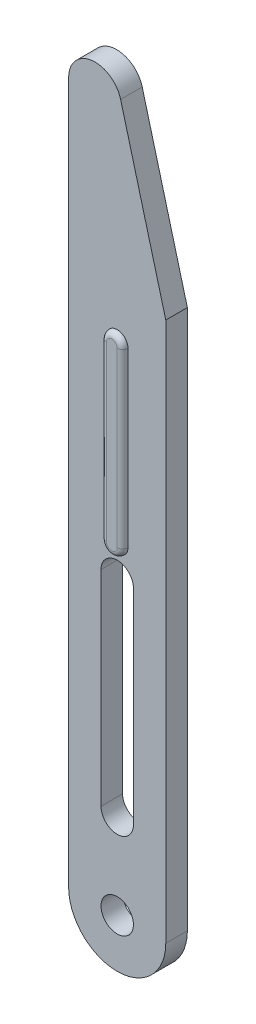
ISO-10303-21;
HEADER;
FILE_DESCRIPTION(('STEP AP214'),'2;1');
FILE_NAME('part.step','',(''),(''),'','','');
FILE_SCHEMA(('AUTOMOTIVE_DESIGN { 1 0 10303 214 1 1 1 1 }'));
ENDSEC;
DATA;
#1=APPLICATION_CONTEXT('core data for automotive mechanical design processes');
#2=APPLICATION_PROTOCOL_DEFINITION('international standard','automotive_design',2000,#1);
#3=PRODUCT_CONTEXT('',#1,'mechanical');
#4=PRODUCT('Part','Part','',(#3));
#5=PRODUCT_RELATED_PRODUCT_CATEGORY('part','',(#4));
#6=PRODUCT_DEFINITION_FORMATION('','',#4);
#7=PRODUCT_DEFINITION_CONTEXT('part definition',#1,'design');
#8=PRODUCT_DEFINITION('design','',#6,#7);
#9=PRODUCT_DEFINITION_SHAPE('','',#8);
#10=(LENGTH_UNIT() NAMED_UNIT(*) SI_UNIT(.MILLI.,.METRE.));
#11=(NAMED_UNIT(*) PLANE_ANGLE_UNIT() SI_UNIT($,.RADIAN.));
#12=(NAMED_UNIT(*) SI_UNIT($,.STERADIAN.) SOLID_ANGLE_UNIT());
#13=UNCERTAINTY_MEASURE_WITH_UNIT(LENGTH_MEASURE(1.E-05),#10,'distance_accuracy_value','');
#14=(GEOMETRIC_REPRESENTATION_CONTEXT(3) GLOBAL_UNCERTAINTY_ASSIGNED_CONTEXT((#13)) GLOBAL_UNIT_ASSIGNED_CONTEXT((#10,
#11,#12)) REPRESENTATION_CONTEXT('',''));
#15=CARTESIAN_POINT('',(0.,0.,0.));
#16=DIRECTION('',(0.,0.,1.));
#17=DIRECTION('',(1.,0.,0.));
#18=AXIS2_PLACEMENT_3D('',#15,#16,#17);
#19=CARTESIAN_POINT('',(4.5,0.,2.));
#20=DIRECTION('',(0.,0.,1.));
#21=DIRECTION('',(1.,0.,0.));
#22=AXIS2_PLACEMENT_3D('',#19,#20,#21);
#23=PLANE('',#22);
#24=CARTESIAN_POINT('',(4.5,0.,2.));
#25=DIRECTION('',(0.,0.,1.));
#26=DIRECTION('',(1.,0.,0.));
#27=AXIS2_PLACEMENT_3D('',#24,#25,#26);
#28=CIRCLE('',#27,1.5);
#29=CARTESIAN_POINT('',(6.,0.,2.));
#30=VERTEX_POINT('',#29);
#31=EDGE_CURVE('E200',#30,#30,#28,.T.);
#32=ORIENTED_EDGE('',*,*,#31,.F.);
#33=EDGE_LOOP('',(#32));
#34=FACE_BOUND('',#33,.T.);
#35=CARTESIAN_POINT('',(4.5,0.,2.));
#36=DIRECTION('',(0.,0.,1.));
#37=DIRECTION('',(1.,0.,0.));
#38=AXIS2_PLACEMENT_3D('',#35,#36,#37);
#39=CIRCLE('',#38,4.5);
#40=CARTESIAN_POINT('',(0.,0.,2.));
#41=VERTEX_POINT('',#40);
#42=CARTESIAN_POINT('',(9.,0.,2.));
#43=VERTEX_POINT('',#42);
#44=EDGE_CURVE('E245',#41,#43,#39,.T.);
#45=ORIENTED_EDGE('',*,*,#44,.T.);
#46=DIRECTION('',(0.,1.,0.));
#47=VECTOR('',#46,1.);
#48=CARTESIAN_POINT('',(9.,0.,2.));
#49=LINE('',#48,#47);
#50=CARTESIAN_POINT('',(9.,50.0211403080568,2.));
#51=VERTEX_POINT('',#50);
#52=EDGE_CURVE('E248',#43,#51,#49,.T.);
#53=ORIENTED_EDGE('',*,*,#52,.T.);
#54=DIRECTION('',(-0.258819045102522,0.965925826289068,0.));
#55=VECTOR('',#54,1.);
#56=CARTESIAN_POINT('',(9.,50.0211403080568,2.));
#57=LINE('',#56,#55);
#58=CARTESIAN_POINT('',(4.81651827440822,65.6341066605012,2.));
#59=VERTEX_POINT('',#58);
#60=EDGE_CURVE('E250',#51,#59,#57,.T.);
#61=ORIENTED_EDGE('',*,*,#60,.T.);
#62=CARTESIAN_POINT('',(2.45,65.,2.));
#63=DIRECTION('',(0.,0.,1.));
#64=DIRECTION('',(1.,0.,0.));
#65=AXIS2_PLACEMENT_3D('',#62,#63,#64);
#66=CIRCLE('',#65,2.45);
#67=CARTESIAN_POINT('',(0.,65.,2.));
#68=VERTEX_POINT('',#67);
#69=EDGE_CURVE('E252',#59,#68,#66,.T.);
#70=ORIENTED_EDGE('',*,*,#69,.T.);
#71=DIRECTION('',(0.,-1.,0.));
#72=VECTOR('',#71,1.);
#73=CARTESIAN_POINT('',(0.,0.,2.));
#74=LINE('',#73,#72);
#75=EDGE_CURVE('E254',#68,#41,#74,.T.);
#76=ORIENTED_EDGE('',*,*,#75,.T.);
#77=EDGE_LOOP('',(#45,#53,#61,#70,#76));
#78=FACE_BOUND('',#77,.T.);
#79=DIRECTION('',(0.,-1.,0.));
#80=VECTOR('',#79,1.);
#81=CARTESIAN_POINT('',(3.,27.,2.));
#82=LINE('',#81,#80);
#83=CARTESIAN_POINT('',(3.,27.,2.));
#84=VERTEX_POINT('',#83);
#85=CARTESIAN_POINT('',(2.99999999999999,8.,2.));
#86=VERTEX_POINT('',#85);
#87=EDGE_CURVE('E217',#84,#86,#82,.T.);
#88=ORIENTED_EDGE('',*,*,#87,.F.);
#89=CARTESIAN_POINT('',(4.5,27.,2.));
#90=DIRECTION('',(0.,0.,1.));
#91=DIRECTION('',(1.,0.,0.));
#92=AXIS2_PLACEMENT_3D('',#89,#90,#91);
#93=CIRCLE('',#92,1.5);
#94=CARTESIAN_POINT('',(6.,27.,2.));
#95=VERTEX_POINT('',#94);
#96=EDGE_CURVE('E215',#95,#84,#93,.T.);
#97=ORIENTED_EDGE('',*,*,#96,.F.);
#98=DIRECTION('',(0.,1.,0.));
#99=VECTOR('',#98,1.);
#100=CARTESIAN_POINT('',(6.,27.,2.));
#101=LINE('',#100,#99);
#102=CARTESIAN_POINT('',(6.,8.,2.));
#103=VERTEX_POINT('',#102);
#104=EDGE_CURVE('E222',#103,#95,#101,.T.);
#105=ORIENTED_EDGE('',*,*,#104,.F.);
#106=CARTESIAN_POINT('',(4.5,8.,2.));
#107=DIRECTION('',(0.,0.,1.));
#108=DIRECTION('',(1.,0.,0.));
#109=AXIS2_PLACEMENT_3D('',#106,#107,#108);
#110=CIRCLE('',#109,1.5);
#111=EDGE_CURVE('E219',#86,#103,#110,.T.);
#112=ORIENTED_EDGE('',*,*,#111,.F.);
#113=EDGE_LOOP('',(#88,#97,#105,#112));
#114=FACE_BOUND('',#113,.T.);
#115=DIRECTION('',(0.,1.,0.));
#116=VECTOR('',#115,1.);
#117=CARTESIAN_POINT('',(3.5,0.,2.));
#118=LINE('',#117,#116);
#119=CARTESIAN_POINT('',(3.49999999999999,30.,2.));
#120=VERTEX_POINT('',#119);
#121=CARTESIAN_POINT('',(3.5,46.,2.));
#122=VERTEX_POINT('',#121);
#123=EDGE_CURVE('E193',#120,#122,#118,.T.);
#124=ORIENTED_EDGE('',*,*,#123,.T.);
#125=CARTESIAN_POINT('',(4.5,46.,2.));
#126=DIRECTION('',(0.,0.,1.));
#127=DIRECTION('',(1.,0.,0.));
#128=AXIS2_PLACEMENT_3D('',#125,#126,#127);
#129=CIRCLE('',#128,1.);
#130=CARTESIAN_POINT('',(5.49999999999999,46.,2.));
#131=VERTEX_POINT('',#130);
#132=EDGE_CURVE('E195',#122,#131,#129,.F.);
#133=ORIENTED_EDGE('',*,*,#132,.T.);
#134=DIRECTION('',(0.,-1.,0.));
#135=VECTOR('',#134,1.);
#136=CARTESIAN_POINT('',(5.5,0.,2.));
#137=LINE('',#136,#135);
#138=CARTESIAN_POINT('',(5.5,30.,2.));
#139=VERTEX_POINT('',#138);
#140=EDGE_CURVE('E188',#131,#139,#137,.T.);
#141=ORIENTED_EDGE('',*,*,#140,.T.);
#142=CARTESIAN_POINT('',(4.5,30.,2.));
#143=DIRECTION('',(0.,0.,1.));
#144=DIRECTION('',(1.,0.,0.));
#145=AXIS2_PLACEMENT_3D('',#142,#143,#144);
#146=CIRCLE('',#145,1.);
#147=EDGE_CURVE('E191',#139,#120,#146,.F.);
#148=ORIENTED_EDGE('',*,*,#147,.T.);
#149=EDGE_LOOP('',(#124,#133,#141,#148));
#150=FACE_BOUND('',#149,.T.);
#151=ADVANCED_FACE('F34',(#34,#78,#114,#150),#23,.T.);
#152=CARTESIAN_POINT('',(4.5,0.,0.));
#153=DIRECTION('',(0.,0.,1.));
#154=DIRECTION('',(1.,0.,0.));
#155=AXIS2_PLACEMENT_3D('',#152,#153,#154);
#156=PLANE('',#155);
#157=CARTESIAN_POINT('',(4.5,0.,0.));
#158=DIRECTION('',(0.,0.,1.));
#159=DIRECTION('',(1.,0.,0.));
#160=AXIS2_PLACEMENT_3D('',#157,#158,#159);
#161=CIRCLE('',#160,1.5);
#162=CARTESIAN_POINT('',(6.,0.,0.));
#163=VERTEX_POINT('',#162);
#164=EDGE_CURVE('E197',#163,#163,#161,.T.);
#165=ORIENTED_EDGE('',*,*,#164,.T.);
#166=EDGE_LOOP('',(#165));
#167=FACE_BOUND('',#166,.T.);
#168=CARTESIAN_POINT('',(4.5,0.,0.));
#169=DIRECTION('',(0.,0.,1.));
#170=DIRECTION('',(1.,0.,0.));
#171=AXIS2_PLACEMENT_3D('',#168,#169,#170);
#172=CIRCLE('',#171,4.5);
#173=CARTESIAN_POINT('',(0.,0.,0.));
#174=VERTEX_POINT('',#173);
#175=CARTESIAN_POINT('',(9.,0.,0.));
#176=VERTEX_POINT('',#175);
#177=EDGE_CURVE('E234',#174,#176,#172,.T.);
#178=ORIENTED_EDGE('',*,*,#177,.F.);
#179=DIRECTION('',(0.,-1.,0.));
#180=VECTOR('',#179,1.);
#181=CARTESIAN_POINT('',(0.,0.,0.));
#182=LINE('',#181,#180);
#183=CARTESIAN_POINT('',(0.,65.,0.));
#184=VERTEX_POINT('',#183);
#185=EDGE_CURVE('E243',#184,#174,#182,.T.);
#186=ORIENTED_EDGE('',*,*,#185,.F.);
#187=CARTESIAN_POINT('',(2.45,65.,0.));
#188=DIRECTION('',(0.,0.,1.));
#189=DIRECTION('',(1.,0.,0.));
#190=AXIS2_PLACEMENT_3D('',#187,#188,#189);
#191=CIRCLE('',#190,2.45);
#192=CARTESIAN_POINT('',(4.81651827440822,65.6341066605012,0.));
#193=VERTEX_POINT('',#192);
#194=EDGE_CURVE('E241',#193,#184,#191,.T.);
#195=ORIENTED_EDGE('',*,*,#194,.F.);
#196=DIRECTION('',(-0.258819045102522,0.965925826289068,0.));
#197=VECTOR('',#196,1.);
#198=CARTESIAN_POINT('',(9.,50.0211403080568,0.));
#199=LINE('',#198,#197);
#200=CARTESIAN_POINT('',(9.,50.0211403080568,0.));
#201=VERTEX_POINT('',#200);
#202=EDGE_CURVE('E239',#201,#193,#199,.T.);
#203=ORIENTED_EDGE('',*,*,#202,.F.);
#204=DIRECTION('',(0.,1.,0.));
#205=VECTOR('',#204,1.);
#206=CARTESIAN_POINT('',(9.,0.,0.));
#207=LINE('',#206,#205);
#208=EDGE_CURVE('E237',#176,#201,#207,.T.);
#209=ORIENTED_EDGE('',*,*,#208,.F.);
#210=EDGE_LOOP('',(#178,#186,#195,#203,#209));
#211=FACE_BOUND('',#210,.T.);
#212=CARTESIAN_POINT('',(4.5,27.,0.));
#213=DIRECTION('',(0.,0.,1.));
#214=DIRECTION('',(1.,0.,0.));
#215=AXIS2_PLACEMENT_3D('',#212,#213,#214);
#216=CIRCLE('',#215,1.5);
#217=CARTESIAN_POINT('',(6.,27.,0.));
#218=VERTEX_POINT('',#217);
#219=CARTESIAN_POINT('',(3.,27.,0.));
#220=VERTEX_POINT('',#219);
#221=EDGE_CURVE('E203',#218,#220,#216,.T.);
#222=ORIENTED_EDGE('',*,*,#221,.T.);
#223=DIRECTION('',(0.,-1.,0.));
#224=VECTOR('',#223,1.);
#225=CARTESIAN_POINT('',(3.,27.,0.));
#226=LINE('',#225,#224);
#227=CARTESIAN_POINT('',(2.99999999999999,8.,0.));
#228=VERTEX_POINT('',#227);
#229=EDGE_CURVE('E206',#220,#228,#226,.T.);
#230=ORIENTED_EDGE('',*,*,#229,.T.);
#231=CARTESIAN_POINT('',(4.5,8.,0.));
#232=DIRECTION('',(0.,0.,1.));
#233=DIRECTION('',(1.,0.,0.));
#234=AXIS2_PLACEMENT_3D('',#231,#232,#233);
#235=CIRCLE('',#234,1.5);
#236=CARTESIAN_POINT('',(6.,8.,0.));
#237=VERTEX_POINT('',#236);
#238=EDGE_CURVE('E209',#228,#237,#235,.T.);
#239=ORIENTED_EDGE('',*,*,#238,.T.);
#240=DIRECTION('',(0.,1.,0.));
#241=VECTOR('',#240,1.);
#242=CARTESIAN_POINT('',(6.,27.,0.));
#243=LINE('',#242,#241);
#244=EDGE_CURVE('E212',#237,#218,#243,.T.);
#245=ORIENTED_EDGE('',*,*,#244,.T.);
#246=EDGE_LOOP('',(#222,#230,#239,#245));
#247=FACE_BOUND('',#246,.T.);
#248=CARTESIAN_POINT('',(4.5,46.,0.));
#249=DIRECTION('',(0.,0.,1.));
#250=DIRECTION('',(1.,0.,0.));
#251=AXIS2_PLACEMENT_3D('',#248,#249,#250);
#252=CIRCLE('',#251,1.);
#253=CARTESIAN_POINT('',(3.5,46.,0.));
#254=VERTEX_POINT('',#253);
#255=CARTESIAN_POINT('',(5.49999999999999,46.,0.));
#256=VERTEX_POINT('',#255);
#257=EDGE_CURVE('E271',#254,#256,#252,.F.);
#258=ORIENTED_EDGE('',*,*,#257,.F.);
#259=DIRECTION('',(0.,1.,0.));
#260=VECTOR('',#259,1.);
#261=CARTESIAN_POINT('',(3.5,0.,0.));
#262=LINE('',#261,#260);
#263=CARTESIAN_POINT('',(3.49999999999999,30.,0.));
#264=VERTEX_POINT('',#263);
#265=EDGE_CURVE('E157',#264,#254,#262,.T.);
#266=ORIENTED_EDGE('',*,*,#265,.F.);
#267=CARTESIAN_POINT('',(4.5,30.,0.));
#268=DIRECTION('',(0.,0.,1.));
#269=DIRECTION('',(1.,0.,0.));
#270=AXIS2_PLACEMENT_3D('',#267,#268,#269);
#271=CIRCLE('',#270,1.);
#272=CARTESIAN_POINT('',(5.5,30.,0.));
#273=VERTEX_POINT('',#272);
#274=EDGE_CURVE('E151',#273,#264,#271,.F.);
#275=ORIENTED_EDGE('',*,*,#274,.F.);
#276=DIRECTION('',(0.,-1.,0.));
#277=VECTOR('',#276,1.);
#278=CARTESIAN_POINT('',(5.5,0.,0.));
#279=LINE('',#278,#277);
#280=EDGE_CURVE('E154',#256,#273,#279,.T.);
#281=ORIENTED_EDGE('',*,*,#280,.F.);
#282=EDGE_LOOP('',(#258,#266,#275,#281));
#283=FACE_BOUND('',#282,.T.);
#284=ADVANCED_FACE('F153',(#167,#211,#247,#283),#156,.F.);
#285=CARTESIAN_POINT('',(4.5,0.,2.));
#286=DIRECTION('',(0.,0.,-1.));
#287=DIRECTION('',(-1.,0.,0.));
#288=AXIS2_PLACEMENT_3D('',#285,#286,#287);
#289=CYLINDRICAL_SURFACE('',#288,4.5);
#290=ORIENTED_EDGE('',*,*,#177,.T.);
#291=DIRECTION('',(0.,0.,-1.));
#292=VECTOR('',#291,1.);
#293=CARTESIAN_POINT('',(9.,0.,2.));
#294=LINE('',#293,#292);
#295=EDGE_CURVE('E168',#43,#176,#294,.T.);
#296=ORIENTED_EDGE('',*,*,#295,.F.);
#297=ORIENTED_EDGE('',*,*,#44,.F.);
#298=DIRECTION('',(0.,0.,-1.));
#299=VECTOR('',#298,1.);
#300=CARTESIAN_POINT('',(0.,0.,2.));
#301=LINE('',#300,#299);
#302=EDGE_CURVE('E256',#41,#174,#301,.T.);
#303=ORIENTED_EDGE('',*,*,#302,.T.);
#304=EDGE_LOOP('',(#290,#296,#297,#303));
#305=FACE_BOUND('',#304,.T.);
#306=ADVANCED_FACE('F36',(#305),#289,.T.);
#307=CARTESIAN_POINT('',(9.,0.,2.));
#308=DIRECTION('',(-1.,0.,0.));
#309=DIRECTION('',(0.,-1.,0.));
#310=AXIS2_PLACEMENT_3D('',#307,#308,#309);
#311=PLANE('',#310);
#312=ORIENTED_EDGE('',*,*,#208,.T.);
#313=DIRECTION('',(0.,0.,-1.));
#314=VECTOR('',#313,1.);
#315=CARTESIAN_POINT('',(9.,50.0211403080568,2.));
#316=LINE('',#315,#314);
#317=EDGE_CURVE('E265',#51,#201,#316,.T.);
#318=ORIENTED_EDGE('',*,*,#317,.F.);
#319=ORIENTED_EDGE('',*,*,#52,.F.);
#320=ORIENTED_EDGE('',*,*,#295,.T.);
#321=EDGE_LOOP('',(#312,#318,#319,#320));
#322=FACE_BOUND('',#321,.T.);
#323=ADVANCED_FACE('F320',(#322),#311,.F.);
#324=CARTESIAN_POINT('',(9.,50.0211403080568,2.));
#325=DIRECTION('',(-0.965925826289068,-0.258819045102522,0.));
#326=DIRECTION('',(0.258819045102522,-0.965925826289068,0.));
#327=AXIS2_PLACEMENT_3D('',#324,#325,#326);
#328=PLANE('',#327);
#329=ORIENTED_EDGE('',*,*,#202,.T.);
#330=DIRECTION('',(0.,0.,-1.));
#331=VECTOR('',#330,1.);
#332=CARTESIAN_POINT('',(4.81651827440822,65.6341066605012,2.));
#333=LINE('',#332,#331);
#334=EDGE_CURVE('E262',#59,#193,#333,.T.);
#335=ORIENTED_EDGE('',*,*,#334,.F.);
#336=ORIENTED_EDGE('',*,*,#60,.F.);
#337=ORIENTED_EDGE('',*,*,#317,.T.);
#338=EDGE_LOOP('',(#329,#335,#336,#337));
#339=FACE_BOUND('',#338,.T.);
#340=ADVANCED_FACE('F317',(#339),#328,.F.);
#341=CARTESIAN_POINT('',(2.45,65.,2.));
#342=DIRECTION('',(0.,0.,-1.));
#343=DIRECTION('',(-1.,0.,0.));
#344=AXIS2_PLACEMENT_3D('',#341,#342,#343);
#345=CYLINDRICAL_SURFACE('',#344,2.45);
#346=ORIENTED_EDGE('',*,*,#194,.T.);
#347=DIRECTION('',(0.,0.,-1.));
#348=VECTOR('',#347,1.);
#349=CARTESIAN_POINT('',(0.,65.,2.));
#350=LINE('',#349,#348);
#351=EDGE_CURVE('E259',#68,#184,#350,.T.);
#352=ORIENTED_EDGE('',*,*,#351,.F.);
#353=ORIENTED_EDGE('',*,*,#69,.F.);
#354=ORIENTED_EDGE('',*,*,#334,.T.);
#355=EDGE_LOOP('',(#346,#352,#353,#354));
#356=FACE_BOUND('',#355,.T.);
#357=ADVANCED_FACE('F313',(#356),#345,.T.);
#358=CARTESIAN_POINT('',(0.,0.,2.));
#359=DIRECTION('',(1.,0.,0.));
#360=DIRECTION('',(0.,0.,-1.));
#361=AXIS2_PLACEMENT_3D('',#358,#359,#360);
#362=PLANE('',#361);
#363=ORIENTED_EDGE('',*,*,#185,.T.);
#364=ORIENTED_EDGE('',*,*,#302,.F.);
#365=ORIENTED_EDGE('',*,*,#75,.F.);
#366=ORIENTED_EDGE('',*,*,#351,.T.);
#367=EDGE_LOOP('',(#363,#364,#365,#366));
#368=FACE_BOUND('',#367,.T.);
#369=ADVANCED_FACE('F309',(#368),#362,.F.);
#370=CARTESIAN_POINT('',(4.5,27.,2.));
#371=DIRECTION('',(0.,0.,-1.));
#372=DIRECTION('',(-1.,0.,0.));
#373=AXIS2_PLACEMENT_3D('',#370,#371,#372);
#374=CYLINDRICAL_SURFACE('',#373,1.5);
#375=ORIENTED_EDGE('',*,*,#221,.F.);
#376=DIRECTION('',(0.,0.,-1.));
#377=VECTOR('',#376,1.);
#378=CARTESIAN_POINT('',(6.,27.,2.));
#379=LINE('',#378,#377);
#380=EDGE_CURVE('E224',#95,#218,#379,.T.);
#381=ORIENTED_EDGE('',*,*,#380,.F.);
#382=ORIENTED_EDGE('',*,*,#96,.T.);
#383=DIRECTION('',(0.,0.,-1.));
#384=VECTOR('',#383,1.);
#385=CARTESIAN_POINT('',(3.,27.,2.));
#386=LINE('',#385,#384);
#387=EDGE_CURVE('E231',#84,#220,#386,.T.);
#388=ORIENTED_EDGE('',*,*,#387,.T.);
#389=EDGE_LOOP('',(#375,#381,#382,#388));
#390=FACE_BOUND('',#389,.T.);
#391=ADVANCED_FACE('F312',(#390),#374,.F.);
#392=CARTESIAN_POINT('',(3.,27.,2.));
#393=DIRECTION('',(1.,0.,0.));
#394=DIRECTION('',(0.,1.,0.));
#395=AXIS2_PLACEMENT_3D('',#392,#393,#394);
#396=PLANE('',#395);
#397=ORIENTED_EDGE('',*,*,#229,.F.);
#398=ORIENTED_EDGE('',*,*,#387,.F.);
#399=ORIENTED_EDGE('',*,*,#87,.T.);
#400=DIRECTION('',(0.,0.,-1.));
#401=VECTOR('',#400,1.);
#402=CARTESIAN_POINT('',(2.99999999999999,8.,2.));
#403=LINE('',#402,#401);
#404=EDGE_CURVE('E229',#86,#228,#403,.T.);
#405=ORIENTED_EDGE('',*,*,#404,.T.);
#406=EDGE_LOOP('',(#397,#398,#399,#405));
#407=FACE_BOUND('',#406,.T.);
#408=ADVANCED_FACE('F390',(#407),#396,.T.);
#409=CARTESIAN_POINT('',(4.5,8.,2.));
#410=DIRECTION('',(0.,0.,-1.));
#411=DIRECTION('',(-1.,0.,0.));
#412=AXIS2_PLACEMENT_3D('',#409,#410,#411);
#413=CYLINDRICAL_SURFACE('',#412,1.5);
#414=ORIENTED_EDGE('',*,*,#238,.F.);
#415=ORIENTED_EDGE('',*,*,#404,.F.);
#416=ORIENTED_EDGE('',*,*,#111,.T.);
#417=DIRECTION('',(0.,0.,-1.));
#418=VECTOR('',#417,1.);
#419=CARTESIAN_POINT('',(6.,8.,2.));
#420=LINE('',#419,#418);
#421=EDGE_CURVE('E227',#103,#237,#420,.T.);
#422=ORIENTED_EDGE('',*,*,#421,.T.);
#423=EDGE_LOOP('',(#414,#415,#416,#422));
#424=FACE_BOUND('',#423,.T.);
#425=ADVANCED_FACE('F386',(#424),#413,.F.);
#426=CARTESIAN_POINT('',(6.,27.,2.));
#427=DIRECTION('',(-1.,0.,0.));
#428=DIRECTION('',(0.,-1.,0.));
#429=AXIS2_PLACEMENT_3D('',#426,#427,#428);
#430=PLANE('',#429);
#431=ORIENTED_EDGE('',*,*,#244,.F.);
#432=ORIENTED_EDGE('',*,*,#421,.F.);
#433=ORIENTED_EDGE('',*,*,#104,.T.);
#434=ORIENTED_EDGE('',*,*,#380,.T.);
#435=EDGE_LOOP('',(#431,#432,#433,#434));
#436=FACE_BOUND('',#435,.T.);
#437=ADVANCED_FACE('F382',(#436),#430,.T.);
#438=CARTESIAN_POINT('',(4.5,0.,2.));
#439=DIRECTION('',(0.,0.,-1.));
#440=DIRECTION('',(-1.,0.,0.));
#441=AXIS2_PLACEMENT_3D('',#438,#439,#440);
#442=CYLINDRICAL_SURFACE('',#441,1.5);
#443=ORIENTED_EDGE('',*,*,#31,.T.);
#444=EDGE_LOOP('',(#443));
#445=FACE_BOUND('',#444,.T.);
#446=ORIENTED_EDGE('',*,*,#164,.F.);
#447=EDGE_LOOP('',(#446));
#448=FACE_BOUND('',#447,.T.);
#449=ADVANCED_FACE('F377',(#445,#448),#442,.F.);
#450=CARTESIAN_POINT('',(4.5,46.,-0.5));
#451=DIRECTION('',(0.,0.,1.));
#452=DIRECTION('',(1.,0.,0.));
#453=AXIS2_PLACEMENT_3D('',#450,#451,#452);
#454=PLANE('',#453);
#455=CARTESIAN_POINT('',(4.5,30.,-0.5));
#456=DIRECTION('',(0.,0.,1.));
#457=DIRECTION('',(1.,0.,0.));
#458=AXIS2_PLACEMENT_3D('',#455,#456,#457);
#459=CIRCLE('',#458,0.500000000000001);
#460=CARTESIAN_POINT('',(5.,30.,-0.5));
#461=VERTEX_POINT('',#460);
#462=CARTESIAN_POINT('',(3.99999999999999,30.,-0.5));
#463=VERTEX_POINT('',#462);
#464=EDGE_CURVE('E42',#461,#463,#459,.F.);
#465=ORIENTED_EDGE('',*,*,#464,.T.);
#466=DIRECTION('',(0.,-1.,0.));
#467=VECTOR('',#466,1.);
#468=CARTESIAN_POINT('',(3.99999999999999,46.,-0.5));
#469=LINE('',#468,#467);
#470=CARTESIAN_POINT('',(4.,46.,-0.5));
#471=VERTEX_POINT('',#470);
#472=EDGE_CURVE('E11',#463,#471,#469,.F.);
#473=ORIENTED_EDGE('',*,*,#472,.T.);
#474=CARTESIAN_POINT('',(4.5,46.,-0.5));
#475=DIRECTION('',(0.,0.,1.));
#476=DIRECTION('',(1.,0.,0.));
#477=AXIS2_PLACEMENT_3D('',#474,#475,#476);
#478=CIRCLE('',#477,0.5);
#479=CARTESIAN_POINT('',(4.99999999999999,46.,-0.5));
#480=VERTEX_POINT('',#479);
#481=EDGE_CURVE('E282',#471,#480,#478,.F.);
#482=ORIENTED_EDGE('',*,*,#481,.T.);
#483=DIRECTION('',(0.,1.,0.));
#484=VECTOR('',#483,1.);
#485=CARTESIAN_POINT('',(4.99999999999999,46.,-0.5));
#486=LINE('',#485,#484);
#487=EDGE_CURVE('E52',#480,#461,#486,.F.);
#488=ORIENTED_EDGE('',*,*,#487,.T.);
#489=EDGE_LOOP('',(#465,#473,#482,#488));
#490=FACE_BOUND('',#489,.T.);
#491=ADVANCED_FACE('F285',(#490),#454,.F.);
#492=CARTESIAN_POINT('',(4.5,46.,2.5));
#493=DIRECTION('',(0.,0.,1.));
#494=DIRECTION('',(1.,0.,0.));
#495=AXIS2_PLACEMENT_3D('',#492,#493,#494);
#496=PLANE('',#495);
#497=CARTESIAN_POINT('',(4.5,30.,2.5));
#498=DIRECTION('',(0.,0.,1.));
#499=DIRECTION('',(1.,0.,0.));
#500=AXIS2_PLACEMENT_3D('',#497,#498,#499);
#501=CIRCLE('',#500,0.500000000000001);
#502=CARTESIAN_POINT('',(3.99999999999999,30.,2.5));
#503=VERTEX_POINT('',#502);
#504=CARTESIAN_POINT('',(5.,30.,2.5));
#505=VERTEX_POINT('',#504);
#506=EDGE_CURVE('E277',#503,#505,#501,.T.);
#507=ORIENTED_EDGE('',*,*,#506,.T.);
#508=DIRECTION('',(0.,1.,0.));
#509=VECTOR('',#508,1.);
#510=CARTESIAN_POINT('',(4.99999999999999,46.,2.5));
#511=LINE('',#510,#509);
#512=CARTESIAN_POINT('',(4.99999999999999,46.,2.5));
#513=VERTEX_POINT('',#512);
#514=EDGE_CURVE('E279',#505,#513,#511,.T.);
#515=ORIENTED_EDGE('',*,*,#514,.T.);
#516=CARTESIAN_POINT('',(4.5,46.,2.5));
#517=DIRECTION('',(0.,0.,1.));
#518=DIRECTION('',(1.,0.,0.));
#519=AXIS2_PLACEMENT_3D('',#516,#517,#518);
#520=CIRCLE('',#519,0.5);
#521=CARTESIAN_POINT('',(4.,46.,2.5));
#522=VERTEX_POINT('',#521);
#523=EDGE_CURVE('E273',#513,#522,#520,.T.);
#524=ORIENTED_EDGE('',*,*,#523,.T.);
#525=DIRECTION('',(0.,-1.,0.));
#526=VECTOR('',#525,1.);
#527=CARTESIAN_POINT('',(3.99999999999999,30.,2.5));
#528=LINE('',#527,#526);
#529=EDGE_CURVE('E275',#522,#503,#528,.T.);
#530=ORIENTED_EDGE('',*,*,#529,.T.);
#531=EDGE_LOOP('',(#507,#515,#524,#530));
#532=FACE_BOUND('',#531,.T.);
#533=ADVANCED_FACE('F369',(#532),#496,.T.);
#534=CARTESIAN_POINT('',(3.99999999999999,46.,2.));
#535=DIRECTION('',(0.,1.,0.));
#536=DIRECTION('',(0.,0.,1.));
#537=AXIS2_PLACEMENT_3D('',#534,#535,#536);
#538=CYLINDRICAL_SURFACE('',#537,0.5);
#539=CARTESIAN_POINT('',(3.99999999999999,46.,2.));
#540=DIRECTION('',(0.,1.,0.));
#541=DIRECTION('',(0.,0.,1.));
#542=AXIS2_PLACEMENT_3D('',#539,#540,#541);
#543=CIRCLE('',#542,0.5);
#544=EDGE_CURVE('E182',#122,#522,#543,.T.);
#545=ORIENTED_EDGE('',*,*,#544,.F.);
#546=ORIENTED_EDGE('',*,*,#123,.F.);
#547=CARTESIAN_POINT('',(3.99999999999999,30.,2.));
#548=DIRECTION('',(0.,-1.,0.));
#549=DIRECTION('',(0.,0.,-1.));
#550=AXIS2_PLACEMENT_3D('',#547,#548,#549);
#551=CIRCLE('',#550,0.5);
#552=EDGE_CURVE('E185',#503,#120,#551,.T.);
#553=ORIENTED_EDGE('',*,*,#552,.F.);
#554=ORIENTED_EDGE('',*,*,#529,.F.);
#555=EDGE_LOOP('',(#545,#546,#553,#554));
#556=FACE_BOUND('',#555,.T.);
#557=ADVANCED_FACE('F356',(#556),#538,.T.);
#558=CARTESIAN_POINT('',(4.5,30.,2.));
#559=DIRECTION('',(0.,0.,1.));
#560=DIRECTION('',(1.,0.,0.));
#561=AXIS2_PLACEMENT_3D('',#558,#559,#560);
#562=TOROIDAL_SURFACE('',#561,0.500000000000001,0.5);
#563=ORIENTED_EDGE('',*,*,#552,.T.);
#564=ORIENTED_EDGE('',*,*,#147,.F.);
#565=CARTESIAN_POINT('',(5.,30.,2.));
#566=DIRECTION('',(0.,1.,0.));
#567=DIRECTION('',(0.,0.,1.));
#568=AXIS2_PLACEMENT_3D('',#565,#566,#567);
#569=CIRCLE('',#568,0.5);
#570=EDGE_CURVE('E180',#505,#139,#569,.T.);
#571=ORIENTED_EDGE('',*,*,#570,.F.);
#572=ORIENTED_EDGE('',*,*,#506,.F.);
#573=EDGE_LOOP('',(#563,#564,#571,#572));
#574=FACE_BOUND('',#573,.T.);
#575=ADVANCED_FACE('F367',(#574),#562,.T.);
#576=CARTESIAN_POINT('',(4.5,46.,2.));
#577=DIRECTION('',(0.,0.,1.));
#578=DIRECTION('',(1.,0.,0.));
#579=AXIS2_PLACEMENT_3D('',#576,#577,#578);
#580=DEGENERATE_TOROIDAL_SURFACE('',#579,0.5,0.5,.T.);
#581=ORIENTED_EDGE('',*,*,#544,.T.);
#582=ORIENTED_EDGE('',*,*,#523,.F.);
#583=CARTESIAN_POINT('',(4.99999999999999,46.,2.));
#584=DIRECTION('',(0.,-1.,0.));
#585=DIRECTION('',(0.,0.,-1.));
#586=AXIS2_PLACEMENT_3D('',#583,#584,#585);
#587=CIRCLE('',#586,0.5);
#588=EDGE_CURVE('E173',#131,#513,#587,.T.);
#589=ORIENTED_EDGE('',*,*,#588,.F.);
#590=ORIENTED_EDGE('',*,*,#132,.F.);
#591=EDGE_LOOP('',(#581,#582,#589,#590));
#592=FACE_BOUND('',#591,.T.);
#593=ADVANCED_FACE('F360',(#592),#580,.T.);
#594=CARTESIAN_POINT('',(4.99999999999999,46.,2.));
#595=DIRECTION('',(0.,-1.,0.));
#596=DIRECTION('',(1.,0.,0.));
#597=AXIS2_PLACEMENT_3D('',#594,#595,#596);
#598=CYLINDRICAL_SURFACE('',#597,0.5);
#599=ORIENTED_EDGE('',*,*,#570,.T.);
#600=ORIENTED_EDGE('',*,*,#140,.F.);
#601=ORIENTED_EDGE('',*,*,#588,.T.);
#602=ORIENTED_EDGE('',*,*,#514,.F.);
#603=EDGE_LOOP('',(#599,#600,#601,#602));
#604=FACE_BOUND('',#603,.T.);
#605=ADVANCED_FACE('F363',(#604),#598,.T.);
#606=CARTESIAN_POINT('',(4.99999999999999,46.,0.));
#607=DIRECTION('',(0.,1.,0.));
#608=DIRECTION('',(-1.,0.,0.));
#609=AXIS2_PLACEMENT_3D('',#606,#607,#608);
#610=CYLINDRICAL_SURFACE('',#609,0.5);
#611=CARTESIAN_POINT('',(5.,30.,0.));
#612=DIRECTION('',(0.,-1.,0.));
#613=DIRECTION('',(0.,0.,-1.));
#614=AXIS2_PLACEMENT_3D('',#611,#612,#613);
#615=CIRCLE('',#614,0.5);
#616=EDGE_CURVE('E164',#461,#273,#615,.T.);
#617=ORIENTED_EDGE('',*,*,#616,.F.);
#618=ORIENTED_EDGE('',*,*,#487,.F.);
#619=CARTESIAN_POINT('',(4.99999999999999,46.,0.));
#620=DIRECTION('',(0.,1.,0.));
#621=DIRECTION('',(0.,0.,1.));
#622=AXIS2_PLACEMENT_3D('',#619,#620,#621);
#623=CIRCLE('',#622,0.5);
#624=EDGE_CURVE('E166',#256,#480,#623,.T.);
#625=ORIENTED_EDGE('',*,*,#624,.F.);
#626=ORIENTED_EDGE('',*,*,#280,.T.);
#627=EDGE_LOOP('',(#617,#618,#625,#626));
#628=FACE_BOUND('',#627,.T.);
#629=ADVANCED_FACE('F163',(#628),#610,.T.);
#630=CARTESIAN_POINT('',(4.5,46.,0.));
#631=DIRECTION('',(0.,0.,1.));
#632=DIRECTION('',(1.,0.,0.));
#633=AXIS2_PLACEMENT_3D('',#630,#631,#632);
#634=DEGENERATE_TOROIDAL_SURFACE('',#633,0.5,0.5,.T.);
#635=ORIENTED_EDGE('',*,*,#624,.T.);
#636=ORIENTED_EDGE('',*,*,#481,.F.);
#637=CARTESIAN_POINT('',(4.,46.,0.));
#638=DIRECTION('',(0.,-1.,0.));
#639=DIRECTION('',(0.,0.,-1.));
#640=AXIS2_PLACEMENT_3D('',#637,#638,#639);
#641=CIRCLE('',#640,0.5);
#642=EDGE_CURVE('E171',#254,#471,#641,.T.);
#643=ORIENTED_EDGE('',*,*,#642,.F.);
#644=ORIENTED_EDGE('',*,*,#257,.T.);
#645=EDGE_LOOP('',(#635,#636,#643,#644));
#646=FACE_BOUND('',#645,.T.);
#647=ADVANCED_FACE('F288',(#646),#634,.T.);
#648=CARTESIAN_POINT('',(4.5,30.,0.));
#649=DIRECTION('',(0.,0.,1.));
#650=DIRECTION('',(1.,0.,0.));
#651=AXIS2_PLACEMENT_3D('',#648,#649,#650);
#652=TOROIDAL_SURFACE('',#651,0.500000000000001,0.5);
#653=ORIENTED_EDGE('',*,*,#616,.T.);
#654=ORIENTED_EDGE('',*,*,#274,.T.);
#655=CARTESIAN_POINT('',(3.99999999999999,30.,0.));
#656=DIRECTION('',(0.,1.,0.));
#657=DIRECTION('',(0.,0.,1.));
#658=AXIS2_PLACEMENT_3D('',#655,#656,#657);
#659=CIRCLE('',#658,0.5);
#660=EDGE_CURVE('E175',#463,#264,#659,.T.);
#661=ORIENTED_EDGE('',*,*,#660,.F.);
#662=ORIENTED_EDGE('',*,*,#464,.F.);
#663=EDGE_LOOP('',(#653,#654,#661,#662));
#664=FACE_BOUND('',#663,.T.);
#665=ADVANCED_FACE('F170',(#664),#652,.T.);
#666=CARTESIAN_POINT('',(3.99999999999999,30.,0.));
#667=DIRECTION('',(0.,-1.,0.));
#668=DIRECTION('',(0.,0.,-1.));
#669=AXIS2_PLACEMENT_3D('',#666,#667,#668);
#670=CYLINDRICAL_SURFACE('',#669,0.5);
#671=ORIENTED_EDGE('',*,*,#642,.T.);
#672=ORIENTED_EDGE('',*,*,#472,.F.);
#673=ORIENTED_EDGE('',*,*,#660,.T.);
#674=ORIENTED_EDGE('',*,*,#265,.T.);
#675=EDGE_LOOP('',(#671,#672,#673,#674));
#676=FACE_BOUND('',#675,.T.);
#677=ADVANCED_FACE('F290',(#676),#670,.T.);
#678=CLOSED_SHELL('',(#151,#284,#306,#323,#340,#357,#369,#391,#408,#425,#437,#449,#491,#533,
#557,#575,#593,#605,#629,#647,#665,#677));
#679=MANIFOLD_SOLID_BREP('B2',#678);
#680=ADVANCED_BREP_SHAPE_REPRESENTATION('',(#18,#679),#14);
#681=SHAPE_DEFINITION_REPRESENTATION(#9,#680);
ENDSEC;
END-ISO-10303-21;
